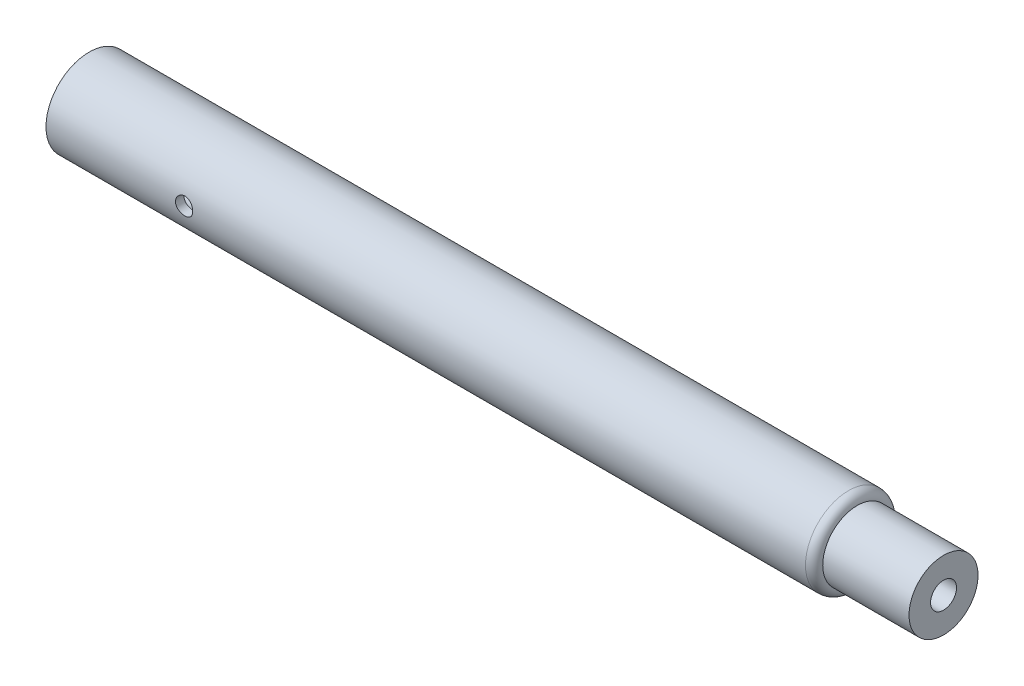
ISO-10303-21;
HEADER;
FILE_DESCRIPTION(('STEP AP214'),'2;1');
FILE_NAME('part.step','',(''),(''),'','','');
FILE_SCHEMA(('AUTOMOTIVE_DESIGN { 1 0 10303 214 1 1 1 1 }'));
ENDSEC;
DATA;
#1=APPLICATION_CONTEXT('core data for automotive mechanical design processes');
#2=APPLICATION_PROTOCOL_DEFINITION('international standard','automotive_design',2000,#1);
#3=PRODUCT_CONTEXT('',#1,'mechanical');
#4=PRODUCT('Part','Part','',(#3));
#5=PRODUCT_RELATED_PRODUCT_CATEGORY('part','',(#4));
#6=PRODUCT_DEFINITION_FORMATION('','',#4);
#7=PRODUCT_DEFINITION_CONTEXT('part definition',#1,'design');
#8=PRODUCT_DEFINITION('design','',#6,#7);
#9=PRODUCT_DEFINITION_SHAPE('','',#8);
#10=(LENGTH_UNIT() NAMED_UNIT(*) SI_UNIT(.MILLI.,.METRE.));
#11=(NAMED_UNIT(*) PLANE_ANGLE_UNIT() SI_UNIT($,.RADIAN.));
#12=(NAMED_UNIT(*) SI_UNIT($,.STERADIAN.) SOLID_ANGLE_UNIT());
#13=UNCERTAINTY_MEASURE_WITH_UNIT(LENGTH_MEASURE(1.E-05),#10,'distance_accuracy_value','');
#14=(GEOMETRIC_REPRESENTATION_CONTEXT(3) GLOBAL_UNCERTAINTY_ASSIGNED_CONTEXT((#13)) GLOBAL_UNIT_ASSIGNED_CONTEXT((#10,
#11,#12)) REPRESENTATION_CONTEXT('',''));
#15=CARTESIAN_POINT('',(0.,0.,0.));
#16=DIRECTION('',(0.,0.,1.));
#17=DIRECTION('',(1.,0.,0.));
#18=AXIS2_PLACEMENT_3D('',#15,#16,#17);
#19=CARTESIAN_POINT('',(2.22044604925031E-13,1.11022302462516E-13,0.));
#20=DIRECTION('',(-1.,0.,0.));
#21=DIRECTION('',(0.,0.,1.));
#22=AXIS2_PLACEMENT_3D('',#19,#20,#21);
#23=CYLINDRICAL_SURFACE('',#22,7.93749999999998);
#24=CARTESIAN_POINT('',(26.9875000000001,0.,-7.93749999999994));
#25=CARTESIAN_POINT('',(26.987496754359,0.0882283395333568,-7.93749837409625));
#26=CARTESIAN_POINT('',(26.980119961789,0.176497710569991,-7.93601386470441));
#27=CARTESIAN_POINT('',(26.9508311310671,0.350541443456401,-7.93023505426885));
#28=CARTESIAN_POINT('',(26.9289075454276,0.43631376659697,-7.92593852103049));
#29=CARTESIAN_POINT('',(26.871229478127,0.602821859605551,-7.91501543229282));
#30=CARTESIAN_POINT('',(26.8354882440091,0.683562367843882,-7.90839110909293));
#31=CARTESIAN_POINT('',(26.751228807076,0.837895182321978,-7.89353256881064));
#32=CARTESIAN_POINT('',(26.7027113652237,0.911487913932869,-7.88529844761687));
#33=CARTESIAN_POINT('',(26.5935801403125,1.05043839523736,-7.86800187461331));
#34=CARTESIAN_POINT('',(26.5328267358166,1.11568539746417,-7.85893058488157));
#35=CARTESIAN_POINT('',(26.4012482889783,1.23513335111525,-7.84104636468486));
#36=CARTESIAN_POINT('',(26.3304224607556,1.28933343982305,-7.83223345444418));
#37=CARTESIAN_POINT('',(26.1799130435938,1.38562040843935,-7.81577751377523));
#38=CARTESIAN_POINT('',(26.1001547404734,1.42759261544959,-7.80814585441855));
#39=CARTESIAN_POINT('',(25.9345401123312,1.49749774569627,-7.79504200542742));
#40=CARTESIAN_POINT('',(25.8486843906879,1.52543205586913,-7.78956960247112));
#41=CARTESIAN_POINT('',(25.6745035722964,1.56610891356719,-7.78149328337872));
#42=CARTESIAN_POINT('',(25.5862255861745,1.5790457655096,-7.77885271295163));
#43=CARTESIAN_POINT('',(25.4087156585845,1.58996400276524,-7.7766287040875));
#44=CARTESIAN_POINT('',(25.3194838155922,1.58794691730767,-7.77704495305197));
#45=CARTESIAN_POINT('',(25.144020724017,1.56917163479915,-7.78085424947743));
#46=CARTESIAN_POINT('',(25.0577645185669,1.55263618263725,-7.78420231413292));
#47=CARTESIAN_POINT('',(24.8892757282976,1.50564514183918,-7.79342717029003));
#48=CARTESIAN_POINT('',(24.8070433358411,1.4751888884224,-7.79930408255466));
#49=CARTESIAN_POINT('',(24.6482945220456,1.40100809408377,-7.81297044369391));
#50=CARTESIAN_POINT('',(24.5718204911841,1.35719526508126,-7.82077255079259));
#51=CARTESIAN_POINT('',(24.4272262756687,1.2576072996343,-7.83740207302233));
#52=CARTESIAN_POINT('',(24.3591070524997,1.20183078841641,-7.84622960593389));
#53=CARTESIAN_POINT('',(24.2318708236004,1.0787061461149,-7.86411021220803));
#54=CARTESIAN_POINT('',(24.172937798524,1.01116790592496,-7.87316448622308));
#55=CARTESIAN_POINT('',(24.0672082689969,0.867068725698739,-7.89033297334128));
#56=CARTESIAN_POINT('',(24.0204119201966,0.790507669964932,-7.89844717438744));
#57=CARTESIAN_POINT('',(23.9402500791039,0.630331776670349,-7.91284120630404));
#58=CARTESIAN_POINT('',(23.9069056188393,0.546706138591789,-7.91911816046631));
#59=CARTESIAN_POINT('',(23.854790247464,0.374886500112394,-7.92910861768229));
#60=CARTESIAN_POINT('',(23.8360175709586,0.2866930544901,-7.93282243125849));
#61=CARTESIAN_POINT('',(23.813839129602,0.109822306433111,-7.93722491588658));
#62=CARTESIAN_POINT('',(23.8101815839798,0.0211777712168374,-7.93796314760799));
#63=CARTESIAN_POINT('',(23.8176591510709,-0.155455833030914,-7.93646894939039));
#64=CARTESIAN_POINT('',(23.8287934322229,-0.243444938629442,-7.93423668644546));
#65=CARTESIAN_POINT('',(23.8653294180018,-0.415457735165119,-7.92708333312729));
#66=CARTESIAN_POINT('',(23.8906019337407,-0.499509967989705,-7.92218660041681));
#67=CARTESIAN_POINT('',(23.9545558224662,-0.662183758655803,-7.91025138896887));
#68=CARTESIAN_POINT('',(23.9932382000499,-0.740804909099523,-7.90321274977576));
#69=CARTESIAN_POINT('',(24.0834584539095,-0.891446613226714,-7.88765109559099));
#70=CARTESIAN_POINT('',(24.1351479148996,-0.963374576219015,-7.87911096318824));
#71=CARTESIAN_POINT('',(24.2497120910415,-1.09762610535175,-7.86153391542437));
#72=CARTESIAN_POINT('',(24.3125880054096,-1.15994864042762,-7.85249694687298));
#73=CARTESIAN_POINT('',(24.448886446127,-1.27419193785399,-7.83477769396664));
#74=CARTESIAN_POINT('',(24.5224549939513,-1.32593985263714,-7.82610290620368));
#75=CARTESIAN_POINT('',(24.6773880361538,-1.41634435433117,-7.81024904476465));
#76=CARTESIAN_POINT('',(24.7587522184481,-1.45500146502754,-7.80306991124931));
#77=CARTESIAN_POINT('',(24.9265570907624,-1.5178910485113,-7.79108075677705));
#78=CARTESIAN_POINT('',(25.0129688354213,-1.54219830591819,-7.78625847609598));
#79=CARTESIAN_POINT('',(25.1887568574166,-1.57592498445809,-7.77950305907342));
#80=CARTESIAN_POINT('',(25.278132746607,-1.58534634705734,-7.77756954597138));
#81=CARTESIAN_POINT('',(25.4555765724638,-1.58896194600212,-7.7768315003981));
#82=CARTESIAN_POINT('',(25.5436388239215,-1.58342931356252,-7.77797084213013));
#83=CARTESIAN_POINT('',(25.7175502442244,-1.55789678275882,-7.78312472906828));
#84=CARTESIAN_POINT('',(25.8033994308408,-1.53789700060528,-7.78713925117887));
#85=CARTESIAN_POINT('',(25.9702739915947,-1.48411972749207,-7.79756606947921));
#86=CARTESIAN_POINT('',(26.0513105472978,-1.4503757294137,-7.80397253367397));
#87=CARTESIAN_POINT('',(26.206614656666,-1.37009924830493,-7.81846472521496));
#88=CARTESIAN_POINT('',(26.2808816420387,-1.32356569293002,-7.82655059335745));
#89=CARTESIAN_POINT('',(26.4218984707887,-1.21809813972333,-7.84366224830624));
#90=CARTESIAN_POINT('',(26.4884991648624,-1.15896689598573,-7.85270166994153));
#91=CARTESIAN_POINT('',(26.6109231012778,-1.03038968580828,-7.87060404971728));
#92=CARTESIAN_POINT('',(26.6667438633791,-0.960941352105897,-7.87946696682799));
#93=CARTESIAN_POINT('',(26.7665749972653,-0.812827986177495,-7.896127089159));
#94=CARTESIAN_POINT('',(26.8104556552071,-0.734074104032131,-7.90391217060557));
#95=CARTESIAN_POINT('',(26.8842904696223,-0.57017659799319,-7.9174201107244));
#96=CARTESIAN_POINT('',(26.9142571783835,-0.485038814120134,-7.92314482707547));
#97=CARTESIAN_POINT('',(26.9536099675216,-0.333091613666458,-7.93077491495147));
#98=CARTESIAN_POINT('',(26.9662960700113,-0.267147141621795,-7.93328206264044));
#99=CARTESIAN_POINT('',(26.9832421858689,-0.134142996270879,-7.93664519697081));
#100=CARTESIAN_POINT('',(26.9875024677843,-0.0670833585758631,-7.93750123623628));
#101=CARTESIAN_POINT('',(26.9875000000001,0.,-7.93749999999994));
#102=B_SPLINE_CURVE_WITH_KNOTS('',3,(#24,#25,#26,#27,#28,#29,#30,#31,#32,#33,#34,#35,#36,#37,
#38,#39,#40,#41,#42,#43,#44,#45,#46,#47,#48,#49,#50,#51,#52,#53,#54,#55,#56,#57,#58,#59,#60,#61,
#62,#63,#64,#65,#66,#67,#68,#69,#70,#71,#72,#73,#74,#75,#76,#77,#78,#79,#80,#81,#82,#83,#84,#85,
#86,#87,#88,#89,#90,#91,#92,#93,#94,#95,#96,#97,#98,#99,#100,#101),.UNSPECIFIED.,.T.,.F.,(4,2,2,
2,2,2,2,2,2,2,2,2,2,2,2,2,2,2,2,2,2,2,2,2,2,2,2,2,2,2,2,2,2,2,2,2,2,2,4),(0.,0.26443960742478,
0.529089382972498,0.793486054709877,1.05786698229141,1.32545561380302,1.5930651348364,
1.86310897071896,2.1331261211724,2.39960443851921,2.66605550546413,2.9284886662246,
3.19093436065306,3.45515390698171,3.71940383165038,3.98840725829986,4.25741413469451,
4.52683998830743,4.79623319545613,5.0611204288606,5.32599277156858,5.58848345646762,
5.85099381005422,6.11671792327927,6.38247053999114,6.65226997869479,6.92205862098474,
7.19042854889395,7.45876347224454,7.72223059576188,7.98569560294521,8.24852238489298,
8.51137121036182,8.77868571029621,9.04606164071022,9.31623575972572,9.58616566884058,
9.78723555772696,9.98829903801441),.UNSPECIFIED.);
#103=CARTESIAN_POINT('',(26.9875000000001,0.,-7.93749999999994));
#104=VERTEX_POINT('',#103);
#105=EDGE_CURVE('E76',#104,#104,#102,.T.);
#106=ORIENTED_EDGE('',*,*,#105,.T.);
#107=EDGE_LOOP('',(#106));
#108=FACE_BOUND('',#107,.T.);
#109=CARTESIAN_POINT('',(26.9875000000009,0.,7.93750000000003));
#110=CARTESIAN_POINT('',(26.9874967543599,-0.0882283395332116,7.93749837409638));
#111=CARTESIAN_POINT('',(26.9801199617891,-0.176497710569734,7.93601386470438));
#112=CARTESIAN_POINT('',(26.950831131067,-0.350541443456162,7.93023505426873));
#113=CARTESIAN_POINT('',(26.9289075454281,-0.436313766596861,7.92593852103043));
#114=CARTESIAN_POINT('',(26.8712294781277,-0.602821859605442,7.9150154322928));
#115=CARTESIAN_POINT('',(26.8354882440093,-0.683562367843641,7.90839110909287));
#116=CARTESIAN_POINT('',(26.7512288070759,-0.83789518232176,7.89353256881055));
#117=CARTESIAN_POINT('',(26.7027113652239,-0.911487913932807,7.88529844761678));
#118=CARTESIAN_POINT('',(26.5935801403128,-1.05043839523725,7.8680018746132));
#119=CARTESIAN_POINT('',(26.5328267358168,-1.11568539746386,7.85893058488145));
#120=CARTESIAN_POINT('',(26.4012482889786,-1.23513335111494,7.84104636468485));
#121=CARTESIAN_POINT('',(26.3304224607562,-1.28933343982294,7.83223345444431));
#122=CARTESIAN_POINT('',(26.1799130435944,-1.38562040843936,7.81577751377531));
#123=CARTESIAN_POINT('',(26.1001547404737,-1.42759261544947,7.80814585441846));
#124=CARTESIAN_POINT('',(25.9345401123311,-1.49749774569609,7.79504200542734));
#125=CARTESIAN_POINT('',(25.8486843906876,-1.52543205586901,7.78956960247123));
#126=CARTESIAN_POINT('',(25.674503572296,-1.56610891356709,7.78149328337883));
#127=CARTESIAN_POINT('',(25.5862255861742,-1.57904576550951,7.77885271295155));
#128=CARTESIAN_POINT('',(25.4087156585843,-1.58996400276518,7.77662870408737));
#129=CARTESIAN_POINT('',(25.3194838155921,-1.58794691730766,7.77704495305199));
#130=CARTESIAN_POINT('',(25.1440207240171,-1.56917163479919,7.78085424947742));
#131=CARTESIAN_POINT('',(25.0577645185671,-1.55263618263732,7.78420231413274));
#132=CARTESIAN_POINT('',(24.889275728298,-1.50564514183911,7.79342717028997));
#133=CARTESIAN_POINT('',(24.8070433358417,-1.47518888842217,7.79930408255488));
#134=CARTESIAN_POINT('',(24.6482945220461,-1.40100809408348,7.81297044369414));
#135=CARTESIAN_POINT('',(24.5718204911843,-1.35719526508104,7.82077255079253));
#136=CARTESIAN_POINT('',(24.4272262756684,-1.25760729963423,7.83740207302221));
#137=CARTESIAN_POINT('',(24.3591070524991,-1.20183078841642,7.84622960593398));
#138=CARTESIAN_POINT('',(24.2318708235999,-1.07870614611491,7.86411021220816));
#139=CARTESIAN_POINT('',(24.1729377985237,-1.01116790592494,7.87316448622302));
#140=CARTESIAN_POINT('',(24.0672082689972,-0.867068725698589,7.89033297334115));
#141=CARTESIAN_POINT('',(24.0204119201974,-0.790507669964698,7.89844717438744));
#142=CARTESIAN_POINT('',(23.9402500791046,-0.630331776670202,7.91284120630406));
#143=CARTESIAN_POINT('',(23.9069056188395,-0.546706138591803,7.91911816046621));
#144=CARTESIAN_POINT('',(23.8547902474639,-0.374886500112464,7.92910861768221));
#145=CARTESIAN_POINT('',(23.8360175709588,-0.286693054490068,7.93282243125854));
#146=CARTESIAN_POINT('',(23.8138391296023,-0.109822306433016,7.93722491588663));
#147=CARTESIAN_POINT('',(23.8101815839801,-0.0211777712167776,7.93796314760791));
#148=CARTESIAN_POINT('',(23.8176591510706,0.155455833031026,7.93646894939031));
#149=CARTESIAN_POINT('',(23.8287934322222,0.243444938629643,7.93423668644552));
#150=CARTESIAN_POINT('',(23.865329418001,0.415457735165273,7.92708333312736));
#151=CARTESIAN_POINT('',(23.8906019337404,0.499509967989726,7.92218660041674));
#152=CARTESIAN_POINT('',(23.9545558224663,0.662183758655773,7.91025138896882));
#153=CARTESIAN_POINT('',(23.99323820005,0.740804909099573,7.90321274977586));
#154=CARTESIAN_POINT('',(24.0834584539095,0.891446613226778,7.8876510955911));
#155=CARTESIAN_POINT('',(24.1351479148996,0.963374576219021,7.87911096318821));
#156=CARTESIAN_POINT('',(24.2497120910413,1.09762610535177,7.86153391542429));
#157=CARTESIAN_POINT('',(24.3125880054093,1.15994864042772,7.85249694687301));
#158=CARTESIAN_POINT('',(24.4488864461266,1.27419193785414,7.83477769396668));
#159=CARTESIAN_POINT('',(24.5224549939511,1.32593985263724,7.82610290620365));
#160=CARTESIAN_POINT('',(24.6773880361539,1.41634435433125,7.81024904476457));
#161=CARTESIAN_POINT('',(24.7587522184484,1.45500146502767,7.80306991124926));
#162=CARTESIAN_POINT('',(24.9265570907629,1.51789104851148,7.791080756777));
#163=CARTESIAN_POINT('',(25.0129688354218,1.5421983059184,7.78625847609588));
#164=CARTESIAN_POINT('',(25.188756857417,1.57592498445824,7.77950305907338));
#165=CARTESIAN_POINT('',(25.2781327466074,1.58534634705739,7.77756954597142));
#166=CARTESIAN_POINT('',(25.4555765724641,1.58896194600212,7.7768315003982));
#167=CARTESIAN_POINT('',(25.5436388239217,1.58342931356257,7.77797084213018));
#168=CARTESIAN_POINT('',(25.7175502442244,1.55789678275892,7.78312472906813));
#169=CARTESIAN_POINT('',(25.8033994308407,1.53789700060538,7.78713925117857));
#170=CARTESIAN_POINT('',(25.9702739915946,1.48411972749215,7.7975660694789));
#171=CARTESIAN_POINT('',(26.0513105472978,1.45037572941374,7.80397253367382));
#172=CARTESIAN_POINT('',(26.2066146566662,1.37009924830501,7.81846472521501));
#173=CARTESIAN_POINT('',(26.2808816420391,1.32356569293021,7.82655059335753));
#174=CARTESIAN_POINT('',(26.421898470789,1.21809813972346,7.84366224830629));
#175=CARTESIAN_POINT('',(26.4884991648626,1.15896689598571,7.85270166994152));
#176=CARTESIAN_POINT('',(26.6109231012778,1.03038968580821,7.8706040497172));
#177=CARTESIAN_POINT('',(26.6667438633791,0.960941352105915,7.87946696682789));
#178=CARTESIAN_POINT('',(26.7665749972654,0.812827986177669,7.89612708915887));
#179=CARTESIAN_POINT('',(26.8104556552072,0.734074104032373,7.90391217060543));
#180=CARTESIAN_POINT('',(26.8842904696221,0.570176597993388,7.91742011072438));
#181=CARTESIAN_POINT('',(26.914257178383,0.485038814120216,7.92314482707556));
#182=CARTESIAN_POINT('',(26.953609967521,0.333091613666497,7.9307749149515));
#183=CARTESIAN_POINT('',(26.966296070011,0.267147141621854,7.93328206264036));
#184=CARTESIAN_POINT('',(26.9832421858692,0.134142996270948,7.93664519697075));
#185=CARTESIAN_POINT('',(26.9875024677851,0.0670833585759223,7.93750123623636));
#186=CARTESIAN_POINT('',(26.9875000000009,0.,7.93750000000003));
#187=B_SPLINE_CURVE_WITH_KNOTS('',3,(#109,#110,#111,#112,#113,#114,#115,#116,#117,#118,#119,
#120,#121,#122,#123,#124,#125,#126,#127,#128,#129,#130,#131,#132,#133,#134,#135,#136,#137,#138,
#139,#140,#141,#142,#143,#144,#145,#146,#147,#148,#149,#150,#151,#152,#153,#154,#155,#156,#157,
#158,#159,#160,#161,#162,#163,#164,#165,#166,#167,#168,#169,#170,#171,#172,#173,#174,#175,#176,
#177,#178,#179,#180,#181,#182,#183,#184,#185,#186),.UNSPECIFIED.,.T.,.F.,(4,2,2,2,2,2,2,2,2,2,2,
2,2,2,2,2,2,2,2,2,2,2,2,2,2,2,2,2,2,2,2,2,2,2,2,2,2,2,4),(0.,0.264439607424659,
0.529089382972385,0.793486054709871,1.05786698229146,1.32545561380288,1.59306513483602,
1.86310897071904,2.13312612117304,2.3996044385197,2.66605550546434,2.92848866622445,
3.19093436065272,3.45515390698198,3.71940383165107,3.98840725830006,4.25741413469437,
4.52683998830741,4.79623319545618,5.06112042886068,5.32599277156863,5.5884834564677,
5.85099381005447,6.11671792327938,6.38247053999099,6.65226997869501,6.92205862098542,
7.19042854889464,7.4587634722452,7.7222305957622,7.98569560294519,8.24852238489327,
8.51137121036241,8.77868571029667,9.04606164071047,9.31623575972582,9.58616566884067,
9.7872355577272,9.98829903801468),.UNSPECIFIED.);
#188=CARTESIAN_POINT('',(26.9875000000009,0.,7.93750000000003));
#189=VERTEX_POINT('',#188);
#190=EDGE_CURVE('E81',#189,#189,#187,.T.);
#191=ORIENTED_EDGE('',*,*,#190,.T.);
#192=EDGE_LOOP('',(#191));
#193=FACE_BOUND('',#192,.T.);
#194=CARTESIAN_POINT('',(2.22044604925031E-13,1.11022302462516E-13,0.));
#195=DIRECTION('',(-1.,0.,0.));
#196=DIRECTION('',(0.,0.,1.));
#197=AXIS2_PLACEMENT_3D('',#194,#195,#196);
#198=CIRCLE('',#197,7.93749999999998);
#199=CARTESIAN_POINT('',(2.23256309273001E-13,1.09480133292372E-13,7.93749999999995));
#200=VERTEX_POINT('',#199);
#201=EDGE_CURVE('E10',#200,#200,#198,.T.);
#202=ORIENTED_EDGE('',*,*,#201,.F.);
#203=EDGE_LOOP('',(#202));
#204=FACE_BOUND('',#203,.T.);
#205=CARTESIAN_POINT('',(139.7127,0.,2.42861286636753E-13));
#206=DIRECTION('',(-1.,0.,0.));
#207=DIRECTION('',(0.,0.,1.));
#208=AXIS2_PLACEMENT_3D('',#205,#206,#207);
#209=CIRCLE('',#208,7.93749999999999);
#210=CARTESIAN_POINT('',(139.7127,0.,7.93750000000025));
#211=VERTEX_POINT('',#210);
#212=EDGE_CURVE('E90',#211,#211,#209,.T.);
#213=ORIENTED_EDGE('',*,*,#212,.T.);
#214=EDGE_LOOP('',(#213));
#215=FACE_BOUND('',#214,.T.);
#216=ADVANCED_FACE('F34',(#108,#193,#204,#215),#23,.T.);
#217=CARTESIAN_POINT('',(-6.66133814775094E-13,6.35000000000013,-1.04083408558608E-13));
#218=DIRECTION('',(1.,0.,0.));
#219=DIRECTION('',(0.,0.,-1.));
#220=AXIS2_PLACEMENT_3D('',#217,#218,#219);
#221=PLANE('',#220);
#222=CARTESIAN_POINT('',(2.22044604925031E-13,1.11022302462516E-13,0.));
#223=DIRECTION('',(-1.,0.,0.));
#224=DIRECTION('',(0.,0.,1.));
#225=AXIS2_PLACEMENT_3D('',#222,#223,#224);
#226=CIRCLE('',#225,6.35000000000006);
#227=CARTESIAN_POINT('',(2.23013968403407E-13,1.09788567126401E-13,6.35000000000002));
#228=VERTEX_POINT('',#227);
#229=EDGE_CURVE('E47',#228,#228,#226,.T.);
#230=ORIENTED_EDGE('',*,*,#229,.F.);
#231=EDGE_LOOP('',(#230));
#232=FACE_BOUND('',#231,.T.);
#233=ORIENTED_EDGE('',*,*,#201,.T.);
#234=EDGE_LOOP('',(#233));
#235=FACE_BOUND('',#234,.T.);
#236=ADVANCED_FACE('F114',(#232,#235),#221,.F.);
#237=CARTESIAN_POINT('',(2.22044604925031E-13,1.11022302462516E-13,0.));
#238=DIRECTION('',(-1.,0.,0.));
#239=DIRECTION('',(0.,0.,1.));
#240=AXIS2_PLACEMENT_3D('',#237,#238,#239);
#241=CYLINDRICAL_SURFACE('',#240,6.35000000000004);
#242=CARTESIAN_POINT('',(26.9875000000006,1.04083408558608E-13,6.3500000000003));
#243=CARTESIAN_POINT('',(26.9874975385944,0.0877105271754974,6.34999851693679));
#244=CARTESIAN_POINT('',(26.9802064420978,0.175448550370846,6.3481646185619));
#245=CARTESIAN_POINT('',(26.9512783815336,0.34841002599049,6.341026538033));
#246=CARTESIAN_POINT('',(26.9296332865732,0.433632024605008,6.33572038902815));
#247=CARTESIAN_POINT('',(26.8727351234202,0.599038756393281,6.32222537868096));
#248=CARTESIAN_POINT('',(26.83749839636,0.679229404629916,6.31403998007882));
#249=CARTESIAN_POINT('',(26.754474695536,0.832561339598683,6.2956582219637));
#250=CARTESIAN_POINT('',(26.7066872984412,0.905702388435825,6.28546179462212));
#251=CARTESIAN_POINT('',(26.5988791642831,1.04436537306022,6.26393012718));
#252=CARTESIAN_POINT('',(26.5386485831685,1.10972143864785,6.25257731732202));
#253=CARTESIAN_POINT('',(26.4081130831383,1.22951761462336,6.23012914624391));
#254=CARTESIAN_POINT('',(26.3378070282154,1.28395649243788,6.21903381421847));
#255=CARTESIAN_POINT('',(26.1878283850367,1.38115309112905,6.19817970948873));
#256=CARTESIAN_POINT('',(26.1080321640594,1.42372526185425,6.18844324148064));
#257=CARTESIAN_POINT('',(25.9421329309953,1.49478672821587,6.17166548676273));
#258=CARTESIAN_POINT('',(25.8560309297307,1.52327827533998,6.16462376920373));
#259=CARTESIAN_POINT('',(25.6817881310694,1.56480386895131,6.15421337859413));
#260=CARTESIAN_POINT('',(25.5937227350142,1.57813615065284,6.15077394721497));
#261=CARTESIAN_POINT('',(25.4165432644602,1.58989371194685,6.14774575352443));
#262=CARTESIAN_POINT('',(25.3274293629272,1.58832141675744,6.14815636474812));
#263=CARTESIAN_POINT('',(25.152968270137,1.57055240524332,6.1527182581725));
#264=CARTESIAN_POINT('',(25.0675821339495,1.55471107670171,6.15677863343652));
#265=CARTESIAN_POINT('',(24.9007195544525,1.50942059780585,6.16803767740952));
#266=CARTESIAN_POINT('',(24.8192433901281,1.47997047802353,6.17523656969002));
#267=CARTESIAN_POINT('',(24.661560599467,1.40799553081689,6.19204495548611));
#268=CARTESIAN_POINT('',(24.5854154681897,1.36534172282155,6.20167804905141));
#269=CARTESIAN_POINT('',(24.441236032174,1.26826039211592,6.22225610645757));
#270=CARTESIAN_POINT('',(24.3732031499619,1.21383080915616,6.23320129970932));
#271=CARTESIAN_POINT('',(24.2451428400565,1.09290212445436,6.25555306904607));
#272=CARTESIAN_POINT('',(24.1853989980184,1.02610312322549,6.26696390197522));
#273=CARTESIAN_POINT('',(24.0779075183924,0.883297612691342,6.28867980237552));
#274=CARTESIAN_POINT('',(24.0301602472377,0.807290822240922,6.29898483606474));
#275=CARTESIAN_POINT('',(23.9479131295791,0.647822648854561,6.31737933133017));
#276=CARTESIAN_POINT('',(23.9134593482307,0.564336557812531,6.32546106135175));
#277=CARTESIAN_POINT('',(23.8591541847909,0.392510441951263,6.33844212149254));
#278=CARTESIAN_POINT('',(23.839300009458,0.304171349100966,6.34334206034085));
#279=CARTESIAN_POINT('',(23.8151907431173,0.12757146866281,6.34931736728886));
#280=CARTESIAN_POINT('',(23.8105494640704,0.0393665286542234,6.35048739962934));
#281=CARTESIAN_POINT('',(23.8159385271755,-0.136559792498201,6.34914068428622));
#282=CARTESIAN_POINT('',(23.8259675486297,-0.224281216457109,6.34662426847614));
#283=CARTESIAN_POINT('',(23.8600942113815,-0.395408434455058,6.33824806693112));
#284=CARTESIAN_POINT('',(23.8839811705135,-0.478858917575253,6.33243837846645));
#285=CARTESIAN_POINT('',(23.9449049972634,-0.640563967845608,6.31813047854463));
#286=CARTESIAN_POINT('',(23.981943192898,-0.71881800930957,6.30963199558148));
#287=CARTESIAN_POINT('',(24.0688665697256,-0.869445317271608,6.29066250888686));
#288=CARTESIAN_POINT('',(24.1189680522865,-0.941689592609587,6.28015917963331));
#289=CARTESIAN_POINT('',(24.2303193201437,-1.07688233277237,6.2583960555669));
#290=CARTESIAN_POINT('',(24.2915710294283,-1.13982918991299,6.24713613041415));
#291=CARTESIAN_POINT('',(24.4252770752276,-1.25623168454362,6.22478812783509));
#292=CARTESIAN_POINT('',(24.497969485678,-1.30941642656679,6.21371105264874));
#293=CARTESIAN_POINT('',(24.6514753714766,-1.40283221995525,6.193291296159));
#294=CARTESIAN_POINT('',(24.7322884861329,-1.44306384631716,6.18394853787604));
#295=CARTESIAN_POINT('',(24.8993085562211,-1.50913192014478,6.16815816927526));
#296=CARTESIAN_POINT('',(24.9854800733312,-1.53505365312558,6.16169345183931));
#297=CARTESIAN_POINT('',(25.1611443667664,-1.57199082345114,6.15237470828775));
#298=CARTESIAN_POINT('',(25.2506364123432,-1.58300952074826,6.14951989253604));
#299=CARTESIAN_POINT('',(25.4276447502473,-1.5896575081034,6.14780437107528));
#300=CARTESIAN_POINT('',(25.5151439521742,-1.58571977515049,6.1488312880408));
#301=CARTESIAN_POINT('',(25.6881882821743,-1.5635576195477,6.15450370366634));
#302=CARTESIAN_POINT('',(25.7737334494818,-1.54533348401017,6.15914912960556));
#303=CARTESIAN_POINT('',(25.9399706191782,-1.49535231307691,6.17147250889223));
#304=CARTESIAN_POINT('',(26.0206884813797,-1.46367648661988,6.17913224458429));
#305=CARTESIAN_POINT('',(26.1757216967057,-1.38775536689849,6.19662374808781));
#306=CARTESIAN_POINT('',(26.2500361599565,-1.34350833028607,6.20645581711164));
#307=CARTESIAN_POINT('',(26.3922453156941,-1.24234336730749,6.22750462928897));
#308=CARTESIAN_POINT('',(26.4599219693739,-1.18512501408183,6.23875080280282));
#309=CARTESIAN_POINT('',(26.5848539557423,-1.06022708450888,6.26118495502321));
#310=CARTESIAN_POINT('',(26.6421068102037,-0.992545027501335,6.27237291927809));
#311=CARTESIAN_POINT('',(26.7455769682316,-0.847161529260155,6.29367185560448));
#312=CARTESIAN_POINT('',(26.7915756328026,-0.769300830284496,6.30375965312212));
#313=CARTESIAN_POINT('',(26.8697577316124,-0.60670657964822,6.32147712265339));
#314=CARTESIAN_POINT('',(26.9019510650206,-0.521978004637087,6.32910855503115));
#315=CARTESIAN_POINT('',(26.9468301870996,-0.364500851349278,6.33992529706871));
#316=CARTESIAN_POINT('',(26.9620483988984,-0.292502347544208,6.34367735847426));
#317=CARTESIAN_POINT('',(26.982383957,-0.14700892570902,6.34871523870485));
#318=CARTESIAN_POINT('',(26.9875020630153,-0.0735141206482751,6.35000124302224));
#319=CARTESIAN_POINT('',(26.9875000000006,1.04083408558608E-13,6.3500000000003));
#320=B_SPLINE_CURVE_WITH_KNOTS('',3,(#242,#243,#244,#245,#246,#247,#248,#249,#250,#251,#252,
#253,#254,#255,#256,#257,#258,#259,#260,#261,#262,#263,#264,#265,#266,#267,#268,#269,#270,#271,
#272,#273,#274,#275,#276,#277,#278,#279,#280,#281,#282,#283,#284,#285,#286,#287,#288,#289,#290,
#291,#292,#293,#294,#295,#296,#297,#298,#299,#300,#301,#302,#303,#304,#305,#306,#307,#308,#309,
#310,#311,#312,#313,#314,#315,#316,#317,#318,#319),.UNSPECIFIED.,.T.,.F.,(4,2,2,2,2,2,2,2,2,2,2,
2,2,2,2,2,2,2,2,2,2,2,2,2,2,2,2,2,2,2,2,2,2,2,2,2,2,2,4),(0.,0.262862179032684,
0.525873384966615,0.788569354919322,1.05127418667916,1.3188361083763,1.58642822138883,
1.85799568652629,2.12951971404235,2.39560412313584,2.6616452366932,2.92123809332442,
3.18084944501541,3.44308141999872,3.70535931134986,3.97511588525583,4.24488069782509,
4.51557209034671,4.78621167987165,5.04992543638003,5.31361545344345,5.57339790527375,
5.83320659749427,6.09762546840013,6.36209000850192,6.63304605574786,6.90399007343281,
7.17330136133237,7.44255372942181,7.70407167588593,7.96558436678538,8.22554023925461,
8.48553217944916,8.75230635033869,9.01914386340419,9.29081396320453,9.56228893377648,
9.78262207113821,10.0029386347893),.UNSPECIFIED.);
#321=CARTESIAN_POINT('',(26.9875000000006,1.04083408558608E-13,6.3500000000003));
#322=VERTEX_POINT('',#321);
#323=EDGE_CURVE('E38',#322,#322,#320,.T.);
#324=ORIENTED_EDGE('',*,*,#323,.T.);
#325=EDGE_LOOP('',(#324));
#326=FACE_BOUND('',#325,.T.);
#327=CARTESIAN_POINT('',(26.9875000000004,0.,-6.34999999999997));
#328=CARTESIAN_POINT('',(26.9874975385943,-0.0877105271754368,-6.34999851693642));
#329=CARTESIAN_POINT('',(26.980206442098,-0.175448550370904,-6.34816461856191));
#330=CARTESIAN_POINT('',(26.9512783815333,-0.348410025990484,-6.34102653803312));
#331=CARTESIAN_POINT('',(26.9296332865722,-0.433632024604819,-6.33572038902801));
#332=CARTESIAN_POINT('',(26.8727351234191,-0.599038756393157,-6.32222537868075));
#333=CARTESIAN_POINT('',(26.8374983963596,-0.679229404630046,-6.31403998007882));
#334=CARTESIAN_POINT('',(26.7544746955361,-0.832561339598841,-6.29565822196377));
#335=CARTESIAN_POINT('',(26.7066872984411,-0.905702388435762,-6.28546179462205));
#336=CARTESIAN_POINT('',(26.5988791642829,-1.04436537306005,-6.26393012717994));
#337=CARTESIAN_POINT('',(26.5386485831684,-1.10972143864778,-6.25257731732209));
#338=CARTESIAN_POINT('',(26.4081130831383,-1.2295176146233,-6.23012914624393));
#339=CARTESIAN_POINT('',(26.3378070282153,-1.28395649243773,-6.21903381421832));
#340=CARTESIAN_POINT('',(26.1878283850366,-1.38115309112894,-6.19817970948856));
#341=CARTESIAN_POINT('',(26.1080321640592,-1.42372526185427,-6.18844324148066));
#342=CARTESIAN_POINT('',(25.942132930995,-1.49478672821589,-6.17166548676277));
#343=CARTESIAN_POINT('',(25.8560309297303,-1.52327827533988,-6.16462376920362));
#344=CARTESIAN_POINT('',(25.6817881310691,-1.56480386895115,-6.15421337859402));
#345=CARTESIAN_POINT('',(25.5937227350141,-1.57813615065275,-6.150773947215));
#346=CARTESIAN_POINT('',(25.4165432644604,-1.58989371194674,-6.14774575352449));
#347=CARTESIAN_POINT('',(25.3274293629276,-1.58832141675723,-6.14815636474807));
#348=CARTESIAN_POINT('',(25.1529682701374,-1.57055240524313,-6.15271825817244));
#349=CARTESIAN_POINT('',(25.0675821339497,-1.55471107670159,-6.15677863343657));
#350=CARTESIAN_POINT('',(24.9007195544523,-1.50942059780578,-6.16803767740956));
#351=CARTESIAN_POINT('',(24.8192433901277,-1.47997047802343,-6.17523656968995));
#352=CARTESIAN_POINT('',(24.6615605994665,-1.40799553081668,-6.19204495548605));
#353=CARTESIAN_POINT('',(24.5854154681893,-1.36534172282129,-6.20167804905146));
#354=CARTESIAN_POINT('',(24.4412360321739,-1.26826039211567,-6.2222561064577));
#355=CARTESIAN_POINT('',(24.3732031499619,-1.21383080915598,-6.23320129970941));
#356=CARTESIAN_POINT('',(24.2451428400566,-1.09290212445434,-6.25555306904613));
#357=CARTESIAN_POINT('',(24.1853989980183,-1.02610312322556,-6.26696390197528));
#358=CARTESIAN_POINT('',(24.0779075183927,-0.883297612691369,-6.28867980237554));
#359=CARTESIAN_POINT('',(24.0301602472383,-0.807290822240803,-6.2989848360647));
#360=CARTESIAN_POINT('',(23.9479131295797,-0.647822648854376,-6.31737933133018));
#361=CARTESIAN_POINT('',(23.913459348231,-0.56433655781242,-6.32546106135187));
#362=CARTESIAN_POINT('',(23.8591541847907,-0.392510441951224,-6.33844212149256));
#363=CARTESIAN_POINT('',(23.8393000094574,-0.304171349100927,-6.34334206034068));
#364=CARTESIAN_POINT('',(23.8151907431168,-0.127571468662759,-6.34931736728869));
#365=CARTESIAN_POINT('',(23.8105494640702,-0.0393665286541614,-6.35048739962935));
#366=CARTESIAN_POINT('',(23.8159385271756,0.136559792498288,-6.34914068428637));
#367=CARTESIAN_POINT('',(23.8259675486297,0.224281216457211,-6.34662426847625));
#368=CARTESIAN_POINT('',(23.8600942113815,0.395408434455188,-6.33824806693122));
#369=CARTESIAN_POINT('',(23.8839811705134,0.478858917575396,-6.33243837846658));
#370=CARTESIAN_POINT('',(23.9449049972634,0.640563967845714,-6.31813047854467));
#371=CARTESIAN_POINT('',(23.9819431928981,0.718818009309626,-6.3096319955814));
#372=CARTESIAN_POINT('',(24.0688665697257,0.869445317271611,-6.29066250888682));
#373=CARTESIAN_POINT('',(24.1189680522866,0.941689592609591,-6.28015917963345));
#374=CARTESIAN_POINT('',(24.2303193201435,1.07688233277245,-6.25839605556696));
#375=CARTESIAN_POINT('',(24.291571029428,1.13982918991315,-6.24713613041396));
#376=CARTESIAN_POINT('',(24.4252770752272,1.25623168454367,-6.22478812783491));
#377=CARTESIAN_POINT('',(24.4979694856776,1.30941642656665,-6.21371105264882));
#378=CARTESIAN_POINT('',(24.6514753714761,1.40283221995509,-6.19329129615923));
#379=CARTESIAN_POINT('',(24.7322884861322,1.44306384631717,-6.18394853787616));
#380=CARTESIAN_POINT('',(24.8993085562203,1.50913192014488,-6.16815816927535));
#381=CARTESIAN_POINT('',(24.9854800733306,1.53505365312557,-6.16169345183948));
#382=CARTESIAN_POINT('',(25.1611443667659,1.57199082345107,-6.15237470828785));
#383=CARTESIAN_POINT('',(25.2506364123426,1.58300952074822,-6.14951989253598));
#384=CARTESIAN_POINT('',(25.4276447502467,1.58965750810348,-6.14780437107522));
#385=CARTESIAN_POINT('',(25.5151439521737,1.58571977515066,-6.14883128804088));
#386=CARTESIAN_POINT('',(25.6881882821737,1.56355761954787,-6.15450370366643));
#387=CARTESIAN_POINT('',(25.7737334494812,1.54533348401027,-6.1591491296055));
#388=CARTESIAN_POINT('',(25.9399706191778,1.49535231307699,-6.17147250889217));
#389=CARTESIAN_POINT('',(26.0206884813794,1.46367648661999,-6.17913224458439));
#390=CARTESIAN_POINT('',(26.1757216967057,1.38775536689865,-6.1966237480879));
#391=CARTESIAN_POINT('',(26.2500361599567,1.34350833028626,-6.20645581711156));
#392=CARTESIAN_POINT('',(26.3922453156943,1.24234336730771,-6.22750462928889));
#393=CARTESIAN_POINT('',(26.459921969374,1.18512501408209,-6.2387508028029));
#394=CARTESIAN_POINT('',(26.5848539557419,1.06022708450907,-6.26118495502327));
#395=CARTESIAN_POINT('',(26.6421068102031,0.992545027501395,-6.27237291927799));
#396=CARTESIAN_POINT('',(26.745576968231,0.847161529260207,-6.29367185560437));
#397=CARTESIAN_POINT('',(26.7915756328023,0.769300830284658,-6.30375965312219));
#398=CARTESIAN_POINT('',(26.8697577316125,0.606706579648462,-6.32147712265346));
#399=CARTESIAN_POINT('',(26.901951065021,0.521978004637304,-6.32910855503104));
#400=CARTESIAN_POINT('',(26.9468301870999,0.364500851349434,-6.33992529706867));
#401=CARTESIAN_POINT('',(26.9620483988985,0.292502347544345,-6.34367735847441));
#402=CARTESIAN_POINT('',(26.9823839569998,0.147008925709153,-6.34871523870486));
#403=CARTESIAN_POINT('',(26.9875020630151,0.0735141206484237,-6.35000124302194));
#404=CARTESIAN_POINT('',(26.9875000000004,0.,-6.34999999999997));
#405=B_SPLINE_CURVE_WITH_KNOTS('',3,(#327,#328,#329,#330,#331,#332,#333,#334,#335,#336,#337,
#338,#339,#340,#341,#342,#343,#344,#345,#346,#347,#348,#349,#350,#351,#352,#353,#354,#355,#356,
#357,#358,#359,#360,#361,#362,#363,#364,#365,#366,#367,#368,#369,#370,#371,#372,#373,#374,#375,
#376,#377,#378,#379,#380,#381,#382,#383,#384,#385,#386,#387,#388,#389,#390,#391,#392,#393,#394,
#395,#396,#397,#398,#399,#400,#401,#402,#403,#404),.UNSPECIFIED.,.T.,.F.,(4,2,2,2,2,2,2,2,2,2,2,
2,2,2,2,2,2,2,2,2,2,2,2,2,2,2,2,2,2,2,2,2,2,2,2,2,2,2,4),(0.,0.262862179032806,0.5258733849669,
0.788569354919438,1.05127418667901,1.31883610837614,1.58642822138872,1.85799568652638,
2.12951971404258,2.39560412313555,2.66164523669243,2.92123809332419,3.18084944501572,
3.4430814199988,3.70535931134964,3.97511588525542,4.24488069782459,4.51557209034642,
4.78621167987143,5.04992543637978,5.31361545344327,5.57339790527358,5.83320659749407,
6.09762546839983,6.3620900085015,6.63304605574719,6.90399007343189,7.17330136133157,
7.4425537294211,7.70407167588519,7.96558436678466,8.22554023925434,8.48553217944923,
8.75230635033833,9.01914386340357,9.29081396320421,9.5622889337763,9.78262207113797,
10.002938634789),.UNSPECIFIED.);
#406=CARTESIAN_POINT('',(26.9875000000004,0.,-6.34999999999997));
#407=VERTEX_POINT('',#406);
#408=EDGE_CURVE('E55',#407,#407,#405,.T.);
#409=ORIENTED_EDGE('',*,*,#408,.T.);
#410=EDGE_LOOP('',(#409));
#411=FACE_BOUND('',#410,.T.);
#412=CARTESIAN_POINT('',(76.2000000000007,0.,0.));
#413=DIRECTION('',(-1.,0.,0.));
#414=DIRECTION('',(0.,0.,1.));
#415=AXIS2_PLACEMENT_3D('',#412,#413,#414);
#416=CIRCLE('',#415,6.35000000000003);
#417=CARTESIAN_POINT('',(76.2000000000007,0.,6.3500000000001));
#418=VERTEX_POINT('',#417);
#419=EDGE_CURVE('E52',#418,#418,#416,.T.);
#420=ORIENTED_EDGE('',*,*,#419,.F.);
#421=EDGE_LOOP('',(#420));
#422=FACE_BOUND('',#421,.T.);
#423=ORIENTED_EDGE('',*,*,#229,.T.);
#424=EDGE_LOOP('',(#423));
#425=FACE_BOUND('',#424,.T.);
#426=ADVANCED_FACE('F60',(#326,#411,#422,#425),#241,.F.);
#427=CARTESIAN_POINT('',(76.2000000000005,4.7752,-1.66533453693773E-13));
#428=DIRECTION('',(1.,0.,0.));
#429=DIRECTION('',(0.,0.,-1.));
#430=AXIS2_PLACEMENT_3D('',#427,#428,#429);
#431=PLANE('',#430);
#432=CARTESIAN_POINT('',(76.2000000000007,0.,0.));
#433=DIRECTION('',(-1.,0.,0.));
#434=DIRECTION('',(0.,0.,1.));
#435=AXIS2_PLACEMENT_3D('',#432,#433,#434);
#436=CIRCLE('',#435,4.77519999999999);
#437=CARTESIAN_POINT('',(76.2000000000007,0.,4.77520000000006));
#438=VERTEX_POINT('',#437);
#439=EDGE_CURVE('E105',#438,#438,#436,.T.);
#440=ORIENTED_EDGE('',*,*,#439,.F.);
#441=EDGE_LOOP('',(#440));
#442=FACE_BOUND('',#441,.T.);
#443=ORIENTED_EDGE('',*,*,#419,.T.);
#444=EDGE_LOOP('',(#443));
#445=FACE_BOUND('',#444,.T.);
#446=ADVANCED_FACE('F110',(#442,#445),#431,.F.);
#447=CARTESIAN_POINT('',(2.22044604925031E-13,1.11022302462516E-13,0.));
#448=DIRECTION('',(-1.,0.,0.));
#449=DIRECTION('',(0.,0.,1.));
#450=AXIS2_PLACEMENT_3D('',#447,#448,#449);
#451=CYLINDRICAL_SURFACE('',#450,4.7752);
#452=CARTESIAN_POINT('',(138.176000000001,0.,0.));
#453=DIRECTION('',(-1.,0.,0.));
#454=DIRECTION('',(0.,0.,1.));
#455=AXIS2_PLACEMENT_3D('',#452,#453,#454);
#456=CIRCLE('',#455,4.7752);
#457=CARTESIAN_POINT('',(138.176000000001,0.,4.77520000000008));
#458=VERTEX_POINT('',#457);
#459=EDGE_CURVE('E102',#458,#458,#456,.T.);
#460=ORIENTED_EDGE('',*,*,#459,.F.);
#461=EDGE_LOOP('',(#460));
#462=FACE_BOUND('',#461,.T.);
#463=ORIENTED_EDGE('',*,*,#439,.T.);
#464=EDGE_LOOP('',(#463));
#465=FACE_BOUND('',#464,.T.);
#466=ADVANCED_FACE('F156',(#462,#465),#451,.F.);
#467=CARTESIAN_POINT('',(138.176000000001,0.,0.));
#468=DIRECTION('',(1.,0.,0.));
#469=DIRECTION('',(0.,0.,-1.));
#470=AXIS2_PLACEMENT_3D('',#467,#468,#469);
#471=PLANE('',#470);
#472=CARTESIAN_POINT('',(138.176000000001,0.,0.));
#473=DIRECTION('',(1.,0.,0.));
#474=DIRECTION('',(0.,0.,-1.));
#475=AXIS2_PLACEMENT_3D('',#472,#473,#474);
#476=CIRCLE('',#475,2.3876);
#477=CARTESIAN_POINT('',(138.176000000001,0.,-2.38759999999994));
#478=VERTEX_POINT('',#477);
#479=EDGE_CURVE('E87',#478,#478,#476,.T.);
#480=ORIENTED_EDGE('',*,*,#479,.T.);
#481=EDGE_LOOP('',(#480));
#482=FACE_BOUND('',#481,.T.);
#483=ORIENTED_EDGE('',*,*,#459,.T.);
#484=EDGE_LOOP('',(#483));
#485=FACE_BOUND('',#484,.T.);
#486=ADVANCED_FACE('F150',(#482,#485),#471,.F.);
#487=CARTESIAN_POINT('',(2.22044604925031E-13,1.11022302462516E-13,0.));
#488=DIRECTION('',(-1.,0.,0.));
#489=DIRECTION('',(0.,0.,1.));
#490=AXIS2_PLACEMENT_3D('',#487,#488,#489);
#491=CYLINDRICAL_SURFACE('',#490,2.3876);
#492=CARTESIAN_POINT('',(157.1752,0.,0.));
#493=DIRECTION('',(-1.,0.,0.));
#494=DIRECTION('',(0.,0.,1.));
#495=AXIS2_PLACEMENT_3D('',#492,#493,#494);
#496=CIRCLE('',#495,2.3876);
#497=CARTESIAN_POINT('',(157.1752,0.,2.3876));
#498=VERTEX_POINT('',#497);
#499=EDGE_CURVE('E99',#498,#498,#496,.T.);
#500=ORIENTED_EDGE('',*,*,#499,.F.);
#501=EDGE_LOOP('',(#500));
#502=FACE_BOUND('',#501,.T.);
#503=ORIENTED_EDGE('',*,*,#479,.F.);
#504=EDGE_LOOP('',(#503));
#505=FACE_BOUND('',#504,.T.);
#506=ADVANCED_FACE('F144',(#502,#505),#491,.F.);
#507=CARTESIAN_POINT('',(157.175200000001,6.34999999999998,0.));
#508=DIRECTION('',(-1.,0.,0.));
#509=DIRECTION('',(0.,0.,1.));
#510=AXIS2_PLACEMENT_3D('',#507,#508,#509);
#511=PLANE('',#510);
#512=CARTESIAN_POINT('',(157.1752,0.,0.));
#513=DIRECTION('',(-1.,0.,0.));
#514=DIRECTION('',(0.,0.,1.));
#515=AXIS2_PLACEMENT_3D('',#512,#513,#514);
#516=CIRCLE('',#515,6.35);
#517=CARTESIAN_POINT('',(157.1752,0.,6.35));
#518=VERTEX_POINT('',#517);
#519=EDGE_CURVE('E96',#518,#518,#516,.T.);
#520=ORIENTED_EDGE('',*,*,#519,.F.);
#521=EDGE_LOOP('',(#520));
#522=FACE_BOUND('',#521,.T.);
#523=ORIENTED_EDGE('',*,*,#499,.T.);
#524=EDGE_LOOP('',(#523));
#525=FACE_BOUND('',#524,.T.);
#526=ADVANCED_FACE('F139',(#522,#525),#511,.F.);
#527=CARTESIAN_POINT('',(2.22044604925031E-13,1.11022302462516E-13,0.));
#528=DIRECTION('',(-1.,0.,0.));
#529=DIRECTION('',(0.,0.,1.));
#530=AXIS2_PLACEMENT_3D('',#527,#528,#529);
#531=CYLINDRICAL_SURFACE('',#530,6.35);
#532=CARTESIAN_POINT('',(141.300200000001,0.,0.));
#533=DIRECTION('',(-1.,0.,0.));
#534=DIRECTION('',(0.,0.,1.));
#535=AXIS2_PLACEMENT_3D('',#532,#533,#534);
#536=CIRCLE('',#535,6.35);
#537=CARTESIAN_POINT('',(141.300200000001,0.,6.34999999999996));
#538=VERTEX_POINT('',#537);
#539=EDGE_CURVE('E93',#538,#538,#536,.T.);
#540=ORIENTED_EDGE('',*,*,#539,.F.);
#541=EDGE_LOOP('',(#540));
#542=FACE_BOUND('',#541,.T.);
#543=ORIENTED_EDGE('',*,*,#519,.T.);
#544=EDGE_LOOP('',(#543));
#545=FACE_BOUND('',#544,.T.);
#546=ADVANCED_FACE('F134',(#542,#545),#531,.T.);
#547=CARTESIAN_POINT('',(139.7127,0.,2.42861286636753E-13));
#548=DIRECTION('',(-1.,0.,0.));
#549=DIRECTION('',(0.,0.,1.));
#550=AXIS2_PLACEMENT_3D('',#547,#548,#549);
#551=TOROIDAL_SURFACE('',#550,6.35,1.58749999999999);
#552=ORIENTED_EDGE('',*,*,#212,.F.);
#553=EDGE_LOOP('',(#552));
#554=FACE_BOUND('',#553,.T.);
#555=ORIENTED_EDGE('',*,*,#539,.T.);
#556=EDGE_LOOP('',(#555));
#557=FACE_BOUND('',#556,.T.);
#558=ADVANCED_FACE('F69',(#554,#557),#551,.T.);
#559=CARTESIAN_POINT('',(25.4000000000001,0.,-7.93749999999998));
#560=DIRECTION('',(0.,0.,1.));
#561=DIRECTION('',(1.,0.,0.));
#562=AXIS2_PLACEMENT_3D('',#559,#560,#561);
#563=CYLINDRICAL_SURFACE('',#562,1.5875);
#564=ORIENTED_EDGE('',*,*,#408,.F.);
#565=EDGE_LOOP('',(#564));
#566=FACE_BOUND('',#565,.T.);
#567=ORIENTED_EDGE('',*,*,#105,.F.);
#568=EDGE_LOOP('',(#567));
#569=FACE_BOUND('',#568,.T.);
#570=ADVANCED_FACE('F67',(#566,#569),#563,.F.);
#571=ORIENTED_EDGE('',*,*,#323,.F.);
#572=EDGE_LOOP('',(#571));
#573=FACE_BOUND('',#572,.T.);
#574=ORIENTED_EDGE('',*,*,#190,.F.);
#575=EDGE_LOOP('',(#574));
#576=FACE_BOUND('',#575,.T.);
#577=ADVANCED_FACE('F63',(#573,#576),#563,.F.);
#578=CLOSED_SHELL('',(#216,#236,#426,#446,#466,#486,#506,#526,#546,#558,#570,#577));
#579=MANIFOLD_SOLID_BREP('B2',#578);
#580=ADVANCED_BREP_SHAPE_REPRESENTATION('',(#18,#579),#14);
#581=SHAPE_DEFINITION_REPRESENTATION(#9,#580);
ENDSEC;
END-ISO-10303-21;
